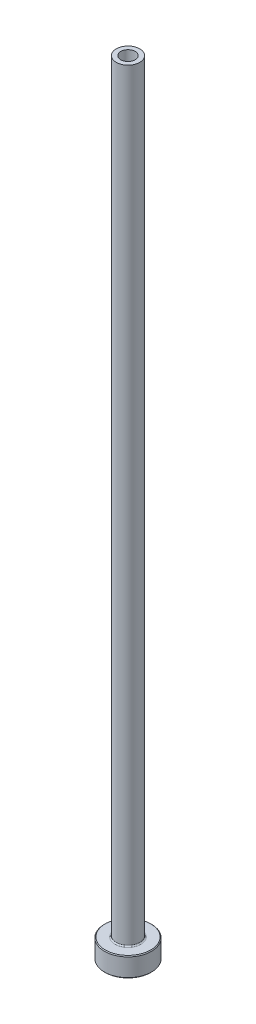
from build123d import *

# Parameters (mm, degrees)
FILLET1_R     = 0.3
CHAMFER1_SIZE = 0.2
CHAMFER3_SIZE = 0.5


with BuildPart() as part:
    # Sketch1 → Revolve1 (revolve)
    with BuildSketch(Plane.XY, mode=Mode.PRIVATE) as revolve1_sk:
        Polygon((-1.85, 200), (-3, 200), (-3, 5), (-6, 5), (-6, 0), (-2.1, 0), (-2.1, 143), (-1.85, 155), align=None)
    revolve(revolve1_sk.sketch.rotate(Axis((0, 92.187680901, 0), (0, -1, 0)), 270), axis=Axis((0, 92.187680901, 0), (0, -1, 0)))

    # Fillet1
    fillet1_edges = [part.edges().sort_by_distance(p)[0] for p in [
        (0, 5, -3),
    ]]
    fillet(fillet1_edges, radius=FILLET1_R)

    # Chamfer1
    chamfer1_edges = [part.edges().sort_by_distance(p)[0] for p in [
        (0, 0, -6),
        (0, 5, -6),
    ]]
    chamfer(chamfer1_edges, length=CHAMFER1_SIZE)

    # Chamfer3
    chamfer3_edges = [part.edges().sort_by_distance(p)[0] for p in [
        (0, 0, -2.1),
    ]]
    chamfer(chamfer3_edges, length=CHAMFER3_SIZE)


solid = part.part
